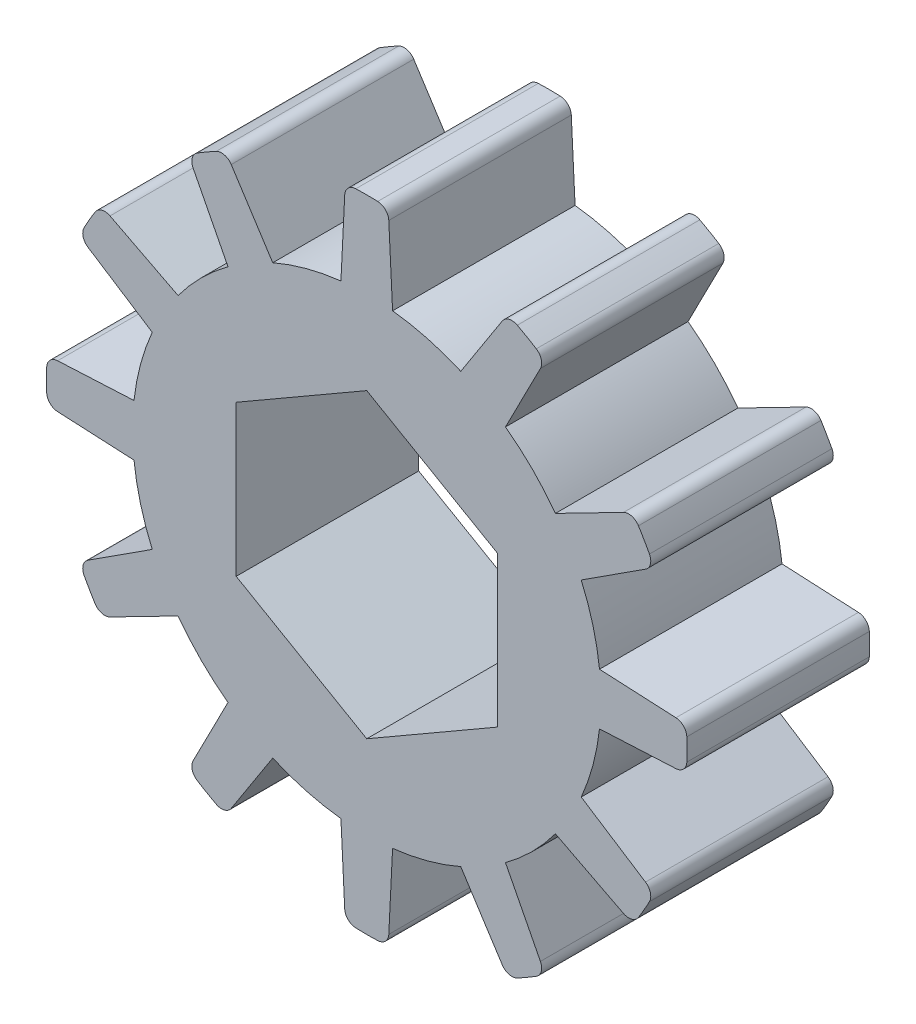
from build123d import *

# Parameters (mm, degrees)
CROQUIS1_R              = 0.5
SALIENTE_EXTRUIR1_DEPTH = 3.18
CORTAR_EXTRUIR3_DEPTH   = 9.508591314
REDONDEO1_R             = 0.2


with BuildPart() as part:
    # Croquis1 → Saliente-Extruir1 (new body)
    with BuildSketch(Plane.XY):
        with BuildLine():
            Line((0.375, 5.567875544), (0.45, 4.055600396))
            ThreePointArc((0.45, 4.055600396), (1.056108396, 3.941450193), (1.638088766, 3.737252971))
            Line((1.638088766, 3.737252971), (2.459178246, 5.009421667))
            ThreePointArc((2.459178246, 5.009421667), (2.790244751, 4.832845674), (3.108697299, 4.634421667))
            Line((3.108697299, 4.634421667), (2.41751163, 3.287252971))
            ThreePointArc((2.41751163, 3.287252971), (2.885341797, 2.885341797), (3.287252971, 2.41751163))
            Line((3.287252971, 2.41751163), (4.634421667, 3.108697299))
            ThreePointArc((4.634421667, 3.108697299), (4.832845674, 2.790244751), (5.009421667, 2.459178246))
            Line((5.009421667, 2.459178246), (3.737252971, 1.638088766))
            ThreePointArc((3.737252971, 1.638088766), (3.941450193, 1.056108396), (4.055600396, 0.45))
            Line((4.055600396, 0.45), (5.567875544, 0.375))
            ThreePointArc((5.567875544, 0.375), (5.580489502, 0), (5.567875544, -0.375))
            Line((5.567875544, -0.375), (4.055600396, -0.45))
            ThreePointArc((4.055600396, -0.45), (3.941450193, -1.056108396), (3.737252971, -1.638088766))
            Line((3.737252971, -1.638088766), (5.009421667, -2.459178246))
            ThreePointArc((5.009421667, -2.459178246), (4.832845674, -2.790244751), (4.634421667, -3.108697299))
            Line((4.634421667, -3.108697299), (3.287252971, -2.41751163))
            ThreePointArc((3.287252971, -2.41751163), (2.885341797, -2.885341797), (2.41751163, -3.287252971))
            Line((2.41751163, -3.287252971), (3.108697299, -4.634421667))
            ThreePointArc((3.108697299, -4.634421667), (2.790244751, -4.832845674), (2.459178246, -5.009421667))
            Line((2.459178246, -5.009421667), (1.638088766, -3.737252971))
            ThreePointArc((1.638088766, -3.737252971), (1.056108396, -3.941450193), (0.45, -4.055600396))
            Line((0.45, -4.055600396), (0.375, -5.567875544))
            ThreePointArc((0.375, -5.567875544), (0, -5.580489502), (-0.375, -5.567875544))
            Line((-0.375, -5.567875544), (-0.45, -4.055600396))
            ThreePointArc((-0.45, -4.055600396), (-1.056108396, -3.941450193), (-1.638088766, -3.737252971))
            Line((-1.638088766, -3.737252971), (-2.459178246, -5.009421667))
            ThreePointArc((-2.459178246, -5.009421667), (-2.790244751, -4.832845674), (-3.108697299, -4.634421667))
            Line((-3.108697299, -4.634421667), (-2.41751163, -3.287252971))
            ThreePointArc((-2.41751163, -3.287252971), (-2.885341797, -2.885341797), (-3.287252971, -2.41751163))
            Line((-3.287252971, -2.41751163), (-4.634421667, -3.108697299))
            ThreePointArc((-4.634421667, -3.108697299), (-4.832845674, -2.790244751), (-5.009421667, -2.459178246))
            Line((-5.009421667, -2.459178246), (-3.737252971, -1.638088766))
            ThreePointArc((-3.737252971, -1.638088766), (-3.941450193, -1.056108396), (-4.055600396, -0.45))
            Line((-4.055600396, -0.45), (-5.567875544, -0.375))
            ThreePointArc((-5.567875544, -0.375), (-5.580489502, 0), (-5.567875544, 0.375))
            Line((-5.567875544, 0.375), (-4.055600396, 0.45))
            ThreePointArc((-4.055600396, 0.45), (-3.941450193, 1.056108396), (-3.737252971, 1.638088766))
            Line((-3.737252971, 1.638088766), (-5.009421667, 2.459178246))
            ThreePointArc((-5.009421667, 2.459178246), (-4.832845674, 2.790244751), (-4.634421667, 3.108697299))
            Line((-4.634421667, 3.108697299), (-3.287252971, 2.41751163))
            ThreePointArc((-3.287252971, 2.41751163), (-2.885341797, 2.885341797), (-2.41751163, 3.287252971))
            Line((-2.41751163, 3.287252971), (-3.108697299, 4.634421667))
            ThreePointArc((-3.108697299, 4.634421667), (-2.790244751, 4.832845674), (-2.459178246, 5.009421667))
            Line((-2.459178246, 5.009421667), (-1.638088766, 3.737252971))
            ThreePointArc((-1.638088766, 3.737252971), (-1.056108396, 3.941450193), (-0.45, 4.055600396))
            Line((-0.45, 4.055600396), (-0.375, 5.567875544))
            ThreePointArc((-0.375, 5.567875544), (0, 5.580489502), (0.375, 5.567875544))
        make_face()
        Circle(CROQUIS1_R, mode=Mode.SUBTRACT)
    extrude(amount=SALIENTE_EXTRUIR1_DEPTH)

    # Croquis10 → Cortar-Extruir3 (cut, through all)
    with BuildSketch(Plane(origin=(0, 0, 0), x_dir=(-1, 0, 0), z_dir=(0, 0, -1))):
        Polygon((0, -2.626943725), (2.275, -1.313471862), (2.275, 1.313471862), (0, 2.626943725), (-2.275, 1.313471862), (-2.275, -1.313471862), align=None)
    extrude(amount=-CORTAR_EXTRUIR3_DEPTH, mode=Mode.SUBTRACT)

    # Redondeo1
    redondeo1_edges = [part.edges().sort_by_distance(p)[0] for p in [
        (0.375, 5.567875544, 1.59),
        (2.459178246, 5.009421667, 1.59),
        (3.108697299, 4.634421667, 1.59),
        (4.634421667, 3.108697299, 1.59),
        (5.009421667, 2.459178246, 1.59),
        (5.567875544, 0.375, 1.59),
        (5.567875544, -0.375, 1.59),
        (5.009421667, -2.459178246, 1.59),
        (4.634421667, -3.108697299, 1.59),
        (3.108697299, -4.634421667, 1.59),
        (2.459178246, -5.009421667, 1.59),
        (0.375, -5.567875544, 1.59),
        (-0.375, -5.567875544, 1.59),
        (-2.459178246, -5.009421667, 1.59),
        (-3.108697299, -4.634421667, 1.59),
        (-4.634421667, -3.108697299, 1.59),
        (-5.009421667, -2.459178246, 1.59),
        (-5.567875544, -0.375, 1.59),
        (-5.567875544, 0.375, 1.59),
        (-5.009421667, 2.459178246, 1.59),
        (-4.634421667, 3.108697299, 1.59),
        (-3.108697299, 4.634421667, 1.59),
        (-2.459178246, 5.009421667, 1.59),
        (-0.375, 5.567875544, 1.59),
    ]]
    fillet(redondeo1_edges, radius=REDONDEO1_R)


solid = part.part
